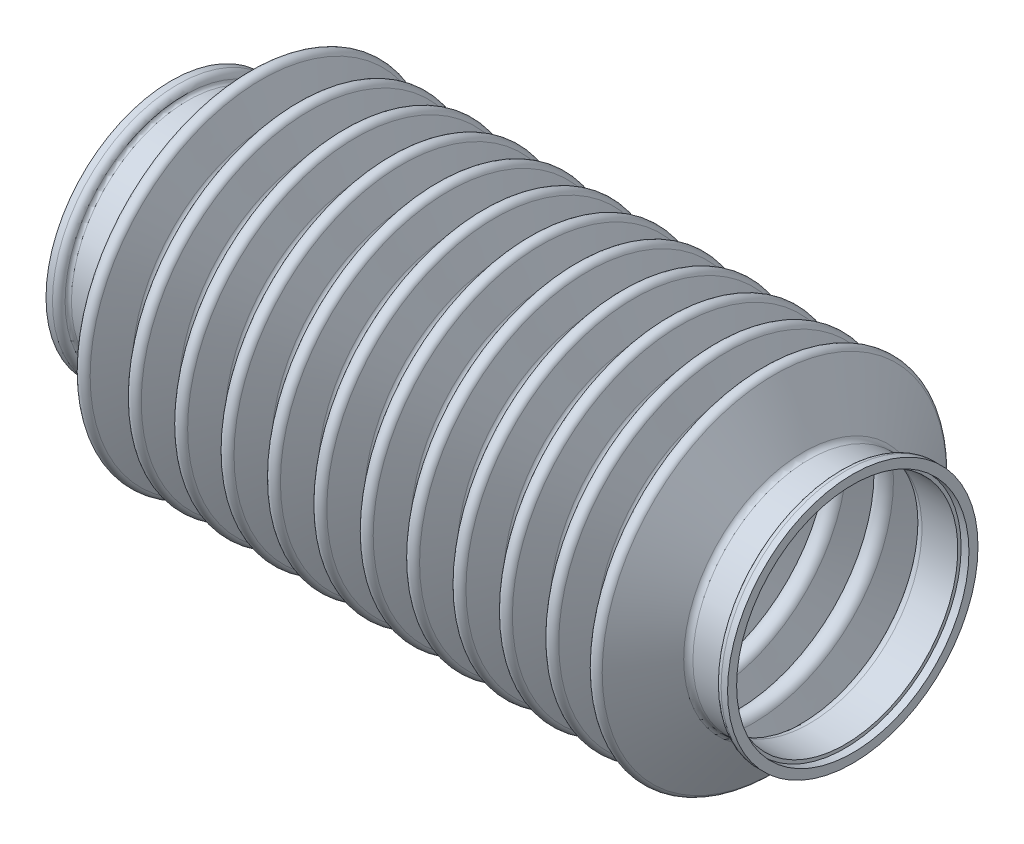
from build123d import *


with BuildPart() as part:
    # Croquis1 → Revoluci_n1 (revolve)
    with BuildSketch(Plane.XY, mode=Mode.PRIVATE) as revoluci_n1_sk:
        with BuildLine():
            Line((-66.121380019, 37.792103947), (-66.121380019, 35.058644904))
            Line((-66.121380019, 35.058644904), (-63.767675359, 35.058644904))
            Line((-63.767675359, 35.058644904), (-63.767675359, 34.058644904))
            Line((-63.767675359, 34.058644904), (-61.183599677, 34.058644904))
            Line((-61.183599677, 34.058644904), (-52.934724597, 34.058644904))
            ThreePointArc((-52.934724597, 34.058644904), (-51.409235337, 34.475452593), (-50.307636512, 35.610056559))
            Line((-50.307636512, 35.610056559), (-41.566637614, 51.462299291))
            ThreePointArc((-41.566637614, 51.462299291), (-40.634754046, 51.977856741), (-39.766598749, 51.360999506))
            Line((-39.766598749, 51.360999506), (-36.049094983, 42.355283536))
            ThreePointArc((-36.049094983, 42.355283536), (-33.276066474, 40.499972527), (-30.503037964, 42.355283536))
            Line((-30.503037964, 42.355283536), (-27.20040931, 50.355957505))
            ThreePointArc((-27.20040931, 50.355957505), (-26.276066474, 50.974394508), (-25.351723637, 50.355957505))
            Line((-25.351723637, 50.355957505), (-22.049094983, 42.355283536))
            ThreePointArc((-22.049094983, 42.355283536), (-19.276066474, 40.499972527), (-16.503037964, 42.355283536))
            Line((-16.503037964, 42.355283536), (-13.20040931, 50.355957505))
            ThreePointArc((-13.20040931, 50.355957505), (-12.276066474, 50.974394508), (-11.351723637, 50.355957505))
            Line((-11.351723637, 50.355957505), (-8.049094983, 42.355283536))
            ThreePointArc((-8.049094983, 42.355283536), (-5.276066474, 40.499972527), (-2.503037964, 42.355283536))
            Line((-2.503037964, 42.355283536), (0.79959069, 50.355957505))
            ThreePointArc((0.79959069, 50.355957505), (1.723933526, 50.974394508), (2.648276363, 50.355957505))
            Line((2.648276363, 50.355957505), (5.950905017, 42.355283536))
            ThreePointArc((5.950905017, 42.355283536), (8.723933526, 40.499972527), (11.496962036, 42.355283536))
            Line((11.496962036, 42.355283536), (14.79959069, 50.355957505))
            ThreePointArc((14.79959069, 50.355957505), (15.723933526, 50.974394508), (16.648276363, 50.355957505))
            Line((16.648276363, 50.355957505), (19.950905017, 42.355283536))
            ThreePointArc((19.950905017, 42.355283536), (22.723933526, 40.499972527), (25.496962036, 42.355283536))
            Line((25.496962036, 42.355283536), (28.79959069, 50.355957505))
            ThreePointArc((28.79959069, 50.355957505), (29.723933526, 50.974394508), (30.648276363, 50.355957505))
            Line((30.648276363, 50.355957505), (33.950905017, 42.355283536))
            ThreePointArc((33.950905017, 42.355283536), (35.055710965, 41.006574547), (36.723933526, 40.499972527))
            ThreePointArc((36.723933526, 40.499972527), (38.392156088, 41.006574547), (39.496962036, 42.355283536))
            Line((39.496962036, 42.355283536), (42.79959069, 50.355957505))
            ThreePointArc((42.79959069, 50.355957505), (43.723933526, 50.974394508), (44.648276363, 50.355957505))
            Line((44.648276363, 50.355957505), (47.950905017, 42.355283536))
            ThreePointArc((47.950905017, 42.355283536), (50.723933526, 40.499972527), (53.496962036, 42.355283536))
            Line((53.496962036, 42.355283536), (56.79959069, 50.355957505))
            ThreePointArc((56.79959069, 50.355957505), (57.723933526, 50.974394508), (58.648276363, 50.355957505))
            Line((58.648276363, 50.355957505), (61.950905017, 42.355283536))
            ThreePointArc((61.950905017, 42.355283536), (64.723933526, 40.499972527), (67.496962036, 42.355283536))
            Line((67.496962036, 42.355283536), (70.79959069, 50.355957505))
            ThreePointArc((70.79959069, 50.355957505), (71.723933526, 50.974394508), (72.648276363, 50.355957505))
            Line((72.648276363, 50.355957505), (75.950905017, 42.355283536))
            ThreePointArc((75.950905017, 42.355283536), (78.723933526, 40.499972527), (81.496962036, 42.355283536))
            Line((81.496962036, 42.355283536), (84.79959069, 50.355957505))
            ThreePointArc((84.79959069, 50.355957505), (85.723933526, 50.974394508), (86.648276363, 50.355957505))
            Line((86.648276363, 50.355957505), (89.950905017, 42.355283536))
            ThreePointArc((89.950905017, 42.355283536), (92.723933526, 40.499972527), (95.496962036, 42.355283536))
            Line((95.496962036, 42.355283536), (98.79959069, 50.355957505))
            ThreePointArc((98.79959069, 50.355957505), (99.723933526, 50.974394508), (100.648276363, 50.355957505))
            Line((100.648276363, 50.355957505), (103.950905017, 42.355283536))
            ThreePointArc((103.950905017, 42.355283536), (106.723933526, 40.499972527), (109.496962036, 42.355283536))
            Line((109.496962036, 42.355283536), (113.214465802, 51.360999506))
            ThreePointArc((113.214465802, 51.360999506), (114.082621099, 51.977856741), (115.014504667, 51.462299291))
            Line((115.014504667, 51.462299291), (123.755503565, 35.610056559))
            ThreePointArc((123.755503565, 35.610056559), (124.85710239, 34.475452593), (126.38259165, 34.058644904))
            Line((126.38259165, 34.058644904), (134.63146673, 34.058644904))
            Line((134.63146673, 34.058644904), (137.215542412, 34.058644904))
            Line((137.215542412, 34.058644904), (137.215542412, 35.058644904))
            Line((137.215542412, 35.058644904), (139.569247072, 35.058644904))
            Line((139.569247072, 35.058644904), (139.569247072, 37.792103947))
            Line((139.569247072, 37.792103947), (137.61960259, 37.792103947))
            ThreePointArc((137.61960259, 37.792103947), (136.269674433, 37.267805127), (135.627512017, 35.969797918))
            ThreePointArc((135.627512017, 35.969797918), (135.306430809, 35.320794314), (134.63146673, 35.058644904))
            Line((134.63146673, 35.058644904), (126.38259165, 35.058644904))
            ThreePointArc((126.38259165, 35.058644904), (125.36559881, 35.336516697), (124.631199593, 36.092919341))
            Line((124.631199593, 36.092919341), (115.890200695, 51.945162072))
            ThreePointArc((115.890200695, 51.945162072), (114.02643356, 52.976276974), (112.290122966, 51.742562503))
            Line((112.290122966, 51.742562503), (108.572619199, 42.736846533))
            ThreePointArc((108.572619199, 42.736846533), (106.723933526, 41.499972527), (104.875247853, 42.736846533))
            Line((104.875247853, 42.736846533), (101.572619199, 50.737520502))
            ThreePointArc((101.572619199, 50.737520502), (99.723933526, 51.974394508), (97.875247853, 50.737520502))
            Line((97.875247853, 50.737520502), (94.572619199, 42.736846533))
            ThreePointArc((94.572619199, 42.736846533), (92.723933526, 41.499972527), (90.875247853, 42.736846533))
            Line((90.875247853, 42.736846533), (87.572619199, 50.737520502))
            ThreePointArc((87.572619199, 50.737520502), (85.723933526, 51.974394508), (83.875247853, 50.737520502))
            Line((83.875247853, 50.737520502), (80.572619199, 42.736846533))
            ThreePointArc((80.572619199, 42.736846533), (78.723933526, 41.499972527), (76.875247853, 42.736846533))
            Line((76.875247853, 42.736846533), (73.572619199, 50.737520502))
            ThreePointArc((73.572619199, 50.737520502), (71.723933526, 51.974394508), (69.875247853, 50.737520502))
            Line((69.875247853, 50.737520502), (66.572619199, 42.736846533))
            ThreePointArc((66.572619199, 42.736846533), (64.723933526, 41.499972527), (62.875247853, 42.736846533))
            Line((62.875247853, 42.736846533), (59.572619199, 50.737520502))
            ThreePointArc((59.572619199, 50.737520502), (57.723933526, 51.974394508), (55.875247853, 50.737520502))
            Line((55.875247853, 50.737520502), (52.572619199, 42.736846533))
            ThreePointArc((52.572619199, 42.736846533), (50.723933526, 41.499972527), (48.875247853, 42.736846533))
            Line((48.875247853, 42.736846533), (45.572619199, 50.737520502))
            ThreePointArc((45.572619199, 50.737520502), (43.723933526, 51.974394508), (41.875247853, 50.737520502))
            Line((41.875247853, 50.737520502), (38.572619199, 42.736846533))
            ThreePointArc((38.572619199, 42.736846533), (37.8360819, 41.837707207), (36.723933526, 41.499972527))
            ThreePointArc((36.723933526, 41.499972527), (35.611785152, 41.837707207), (34.875247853, 42.736846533))
            Line((34.875247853, 42.736846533), (31.572619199, 50.737520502))
            ThreePointArc((31.572619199, 50.737520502), (29.723933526, 51.974394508), (27.875247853, 50.737520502))
            Line((27.875247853, 50.737520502), (24.572619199, 42.736846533))
            ThreePointArc((24.572619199, 42.736846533), (22.723933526, 41.499972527), (20.875247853, 42.736846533))
            Line((20.875247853, 42.736846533), (17.572619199, 50.737520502))
            ThreePointArc((17.572619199, 50.737520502), (15.723933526, 51.974394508), (13.875247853, 50.737520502))
            Line((13.875247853, 50.737520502), (10.572619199, 42.736846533))
            ThreePointArc((10.572619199, 42.736846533), (8.723933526, 41.499972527), (6.875247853, 42.736846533))
            Line((6.875247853, 42.736846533), (3.572619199, 50.737520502))
            ThreePointArc((3.572619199, 50.737520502), (1.723933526, 51.974394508), (-0.124752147, 50.737520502))
            Line((-0.124752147, 50.737520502), (-3.427380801, 42.736846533))
            ThreePointArc((-3.427380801, 42.736846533), (-5.276066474, 41.499972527), (-7.124752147, 42.736846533))
            Line((-7.124752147, 42.736846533), (-10.427380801, 50.737520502))
            ThreePointArc((-10.427380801, 50.737520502), (-12.276066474, 51.974394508), (-14.124752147, 50.737520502))
            Line((-14.124752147, 50.737520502), (-17.427380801, 42.736846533))
            ThreePointArc((-17.427380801, 42.736846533), (-19.276066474, 41.499972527), (-21.124752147, 42.736846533))
            Line((-21.124752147, 42.736846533), (-24.427380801, 50.737520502))
            ThreePointArc((-24.427380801, 50.737520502), (-26.276066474, 51.974394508), (-28.124752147, 50.737520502))
            Line((-28.124752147, 50.737520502), (-31.427380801, 42.736846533))
            ThreePointArc((-31.427380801, 42.736846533), (-33.276066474, 41.499972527), (-35.124752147, 42.736846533))
            Line((-35.124752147, 42.736846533), (-38.842255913, 51.742562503))
            ThreePointArc((-38.842255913, 51.742562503), (-40.578566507, 52.976276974), (-42.442333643, 51.945162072))
            Line((-42.442333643, 51.945162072), (-51.18333254, 36.092919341))
            ThreePointArc((-51.18333254, 36.092919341), (-51.917731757, 35.336516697), (-52.934724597, 35.058644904))
            Line((-52.934724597, 35.058644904), (-61.183599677, 35.058644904))
            ThreePointArc((-61.183599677, 35.058644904), (-61.858563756, 35.320794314), (-62.179644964, 35.969797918))
            ThreePointArc((-62.179644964, 35.969797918), (-62.821807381, 37.267805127), (-64.171735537, 37.792103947))
            Line((-64.171735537, 37.792103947), (-66.121380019, 37.792103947))
        make_face()
    revolve(revoluci_n1_sk.sketch.rotate(Axis((-62.171735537, 0, 0), (1, 0, 0)), 90), axis=Axis((-62.171735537, 0, 0), (1, 0, 0)))


solid = part.part
